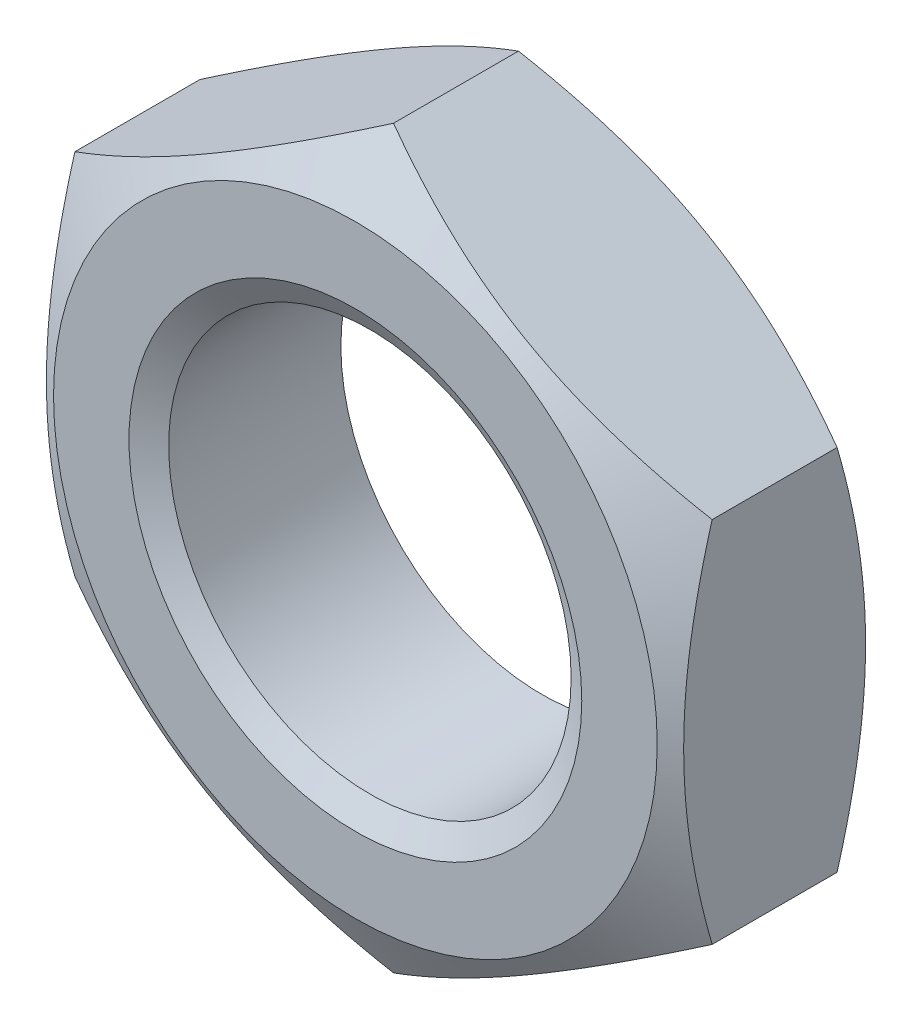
ISO-10303-21;
HEADER;
FILE_DESCRIPTION(('STEP AP214'),'2;1');
FILE_NAME('part.step','',(''),(''),'','','');
FILE_SCHEMA(('AUTOMOTIVE_DESIGN { 1 0 10303 214 1 1 1 1 }'));
ENDSEC;
DATA;
#1=APPLICATION_CONTEXT('core data for automotive mechanical design processes');
#2=APPLICATION_PROTOCOL_DEFINITION('international standard','automotive_design',2000,#1);
#3=PRODUCT_CONTEXT('',#1,'mechanical');
#4=PRODUCT('Part','Part','',(#3));
#5=PRODUCT_RELATED_PRODUCT_CATEGORY('part','',(#4));
#6=PRODUCT_DEFINITION_FORMATION('','',#4);
#7=PRODUCT_DEFINITION_CONTEXT('part definition',#1,'design');
#8=PRODUCT_DEFINITION('design','',#6,#7);
#9=PRODUCT_DEFINITION_SHAPE('','',#8);
#10=(LENGTH_UNIT() NAMED_UNIT(*) SI_UNIT(.MILLI.,.METRE.));
#11=(NAMED_UNIT(*) PLANE_ANGLE_UNIT() SI_UNIT($,.RADIAN.));
#12=(NAMED_UNIT(*) SI_UNIT($,.STERADIAN.) SOLID_ANGLE_UNIT());
#13=UNCERTAINTY_MEASURE_WITH_UNIT(LENGTH_MEASURE(1.E-05),#10,'distance_accuracy_value','');
#14=(GEOMETRIC_REPRESENTATION_CONTEXT(3) GLOBAL_UNCERTAINTY_ASSIGNED_CONTEXT((#13)) GLOBAL_UNIT_ASSIGNED_CONTEXT((#10,
#11,#12)) REPRESENTATION_CONTEXT('',''));
#15=CARTESIAN_POINT('',(0.,0.,0.));
#16=DIRECTION('',(0.,0.,1.));
#17=DIRECTION('',(1.,0.,0.));
#18=AXIS2_PLACEMENT_3D('',#15,#16,#17);
#19=CARTESIAN_POINT('',(0.,0.,0.));
#20=DIRECTION('',(0.,0.,1.));
#21=DIRECTION('',(1.,0.,0.));
#22=AXIS2_PLACEMENT_3D('',#19,#20,#21);
#23=PLANE('',#22);
#24=CARTESIAN_POINT('',(0.,0.,0.));
#25=DIRECTION('',(0.,0.,1.));
#26=DIRECTION('',(1.,0.,0.));
#27=AXIS2_PLACEMENT_3D('',#24,#25,#26);
#28=CIRCLE('',#27,6.75);
#29=CARTESIAN_POINT('',(6.75,0.,0.));
#30=VERTEX_POINT('',#29);
#31=EDGE_CURVE('E23',#30,#30,#28,.T.);
#32=ORIENTED_EDGE('',*,*,#31,.T.);
#33=EDGE_LOOP('',(#32));
#34=FACE_BOUND('',#33,.T.);
#35=CARTESIAN_POINT('',(0.,0.,0.));
#36=DIRECTION('',(0.,0.,-1.));
#37=DIRECTION('',(-1.,0.,0.));
#38=AXIS2_PLACEMENT_3D('',#35,#36,#37);
#39=CIRCLE('',#38,9.);
#40=CARTESIAN_POINT('',(-9.,0.,0.));
#41=VERTEX_POINT('',#40);
#42=EDGE_CURVE('E146',#41,#41,#39,.T.);
#43=ORIENTED_EDGE('',*,*,#42,.T.);
#44=EDGE_LOOP('',(#43));
#45=FACE_BOUND('',#44,.T.);
#46=ADVANCED_FACE('F14',(#34,#45),#23,.F.);
#47=CARTESIAN_POINT('',(0.,0.,6.));
#48=DIRECTION('',(0.,0.,1.));
#49=DIRECTION('',(1.,0.,0.));
#50=AXIS2_PLACEMENT_3D('',#47,#48,#49);
#51=PLANE('',#50);
#52=CARTESIAN_POINT('',(0.,0.,6.));
#53=DIRECTION('',(0.,0.,1.));
#54=DIRECTION('',(1.,0.,0.));
#55=AXIS2_PLACEMENT_3D('',#52,#53,#54);
#56=CIRCLE('',#55,6.75);
#57=CARTESIAN_POINT('',(6.75,0.,6.));
#58=VERTEX_POINT('',#57);
#59=EDGE_CURVE('E9',#58,#58,#56,.F.);
#60=ORIENTED_EDGE('',*,*,#59,.T.);
#61=EDGE_LOOP('',(#60));
#62=FACE_BOUND('',#61,.T.);
#63=CARTESIAN_POINT('',(0.,0.,6.));
#64=DIRECTION('',(0.,0.,-1.));
#65=DIRECTION('',(-1.,0.,0.));
#66=AXIS2_PLACEMENT_3D('',#63,#64,#65);
#67=CIRCLE('',#66,9.);
#68=CARTESIAN_POINT('',(-9.,0.,6.));
#69=VERTEX_POINT('',#68);
#70=EDGE_CURVE('E214',#69,#69,#67,.T.);
#71=ORIENTED_EDGE('',*,*,#70,.F.);
#72=EDGE_LOOP('',(#71));
#73=FACE_BOUND('',#72,.T.);
#74=ADVANCED_FACE('F239',(#62,#73),#51,.T.);
#75=CARTESIAN_POINT('',(9.5,5.48482755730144,6.));
#76=DIRECTION('',(-0.5,-0.866025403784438,0.));
#77=DIRECTION('',(0.866025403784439,-0.5,0.));
#78=AXIS2_PLACEMENT_3D('',#75,#76,#77);
#79=PLANE('',#78);
#80=DIRECTION('',(0.,0.,-1.));
#81=VECTOR('',#80,1.);
#82=CARTESIAN_POINT('',(9.5,5.48482755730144,6.));
#83=LINE('',#82,#81);
#84=CARTESIAN_POINT('',(9.5,5.48482755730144,4.8628190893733));
#85=VERTEX_POINT('',#84);
#86=CARTESIAN_POINT('',(9.5,5.48482755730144,1.1371809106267));
#87=VERTEX_POINT('',#86);
#88=EDGE_CURVE('E203',#85,#87,#83,.T.);
#89=ORIENTED_EDGE('',*,*,#88,.T.);
#90=CARTESIAN_POINT('',(9.5002,5.4847120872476,1.13724757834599));
#91=CARTESIAN_POINT('',(9.2913692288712,5.60528058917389,1.06764857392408));
#92=CARTESIAN_POINT('',(9.08175982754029,5.72629863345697,1.00120844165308));
#93=CARTESIAN_POINT('',(8.66086011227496,5.96930519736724,0.875522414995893));
#94=CARTESIAN_POINT('',(8.44956926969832,6.09129402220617,0.816278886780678));
#95=CARTESIAN_POINT('',(7.81229220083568,6.45922610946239,0.650489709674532));
#96=CARTESIAN_POINT('',(7.38379023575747,6.70662183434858,0.556189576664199));
#97=CARTESIAN_POINT('',(6.74255666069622,7.07683821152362,0.445613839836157));
#98=CARTESIAN_POINT('',(6.53174078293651,7.19855281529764,0.41411496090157));
#99=CARTESIAN_POINT('',(6.10913296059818,7.44254555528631,0.361293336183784));
#100=CARTESIAN_POINT('',(5.89734099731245,7.56482370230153,0.339970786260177));
#101=CARTESIAN_POINT('',(5.4734037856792,7.80958396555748,0.308048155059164));
#102=CARTESIAN_POINT('',(5.26125925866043,7.93206566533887,0.297435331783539));
#103=CARTESIAN_POINT('',(4.83677424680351,8.17714220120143,0.28715766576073));
#104=CARTESIAN_POINT('',(4.62443376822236,8.29973703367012,0.287492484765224));
#105=CARTESIAN_POINT('',(4.22745800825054,8.52893109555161,0.29834850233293));
#106=CARTESIAN_POINT('',(4.04279470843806,8.63554650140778,0.30754540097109));
#107=CARTESIAN_POINT('',(3.67389999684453,8.84852796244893,0.33404053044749));
#108=CARTESIAN_POINT('',(3.48966861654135,8.95489399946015,0.351339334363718));
#109=CARTESIAN_POINT('',(2.93768832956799,9.27357996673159,0.414979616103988));
#110=CARTESIAN_POINT('',(2.57091646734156,9.4853358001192,0.473057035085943));
#111=CARTESIAN_POINT('',(1.83348217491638,9.91109368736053,0.618251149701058));
#112=CARTESIAN_POINT('',(1.46291385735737,10.1250414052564,0.705983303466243));
#113=CARTESIAN_POINT('',(0.727303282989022,10.5497463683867,0.905098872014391));
#114=CARTESIAN_POINT('',(0.362251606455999,10.7605090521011,1.01643552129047));
#115=CARTESIAN_POINT('',(-0.000199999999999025,10.9697705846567,1.13724757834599));
#116=B_SPLINE_CURVE_WITH_KNOTS('',3,(#90,#91,#92,#93,#94,#95,#96,#97,#98,#99,#100,#101,#102,
#103,#104,#105,#106,#107,#108,#109,#110,#111,#112,#113,#114,#115),.UNSPECIFIED.,.F.,.F.,(4,2,2,
2,2,2,2,2,2,2,2,2,4),(0.,0.752880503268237,1.50600787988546,3.01546870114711,3.75167336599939,
4.48789219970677,5.22323407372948,5.95855322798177,6.59868084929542,7.23885375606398,
8.52010929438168,9.82978009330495,11.1368800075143),.UNSPECIFIED.);
#117=CARTESIAN_POINT('',(0.,10.9696551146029,1.1371809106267));
#118=VERTEX_POINT('',#117);
#119=EDGE_CURVE('E30',#87,#118,#116,.T.);
#120=ORIENTED_EDGE('',*,*,#119,.T.);
#121=DIRECTION('',(0.,0.,-1.));
#122=VECTOR('',#121,1.);
#123=CARTESIAN_POINT('',(0.,10.9696551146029,6.));
#124=LINE('',#123,#122);
#125=CARTESIAN_POINT('',(0.,10.9696551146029,4.8628190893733));
#126=VERTEX_POINT('',#125);
#127=EDGE_CURVE('E84',#126,#118,#124,.T.);
#128=ORIENTED_EDGE('',*,*,#127,.F.);
#129=CARTESIAN_POINT('',(-0.000199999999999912,10.9697705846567,4.86275242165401));
#130=CARTESIAN_POINT('',(0.208630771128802,10.8492020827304,4.93235142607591));
#131=CARTESIAN_POINT('',(0.418240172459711,10.7281840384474,4.99879155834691));
#132=CARTESIAN_POINT('',(0.83913988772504,10.4851774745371,5.1244775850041));
#133=CARTESIAN_POINT('',(1.05043073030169,10.3631886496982,5.18372111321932));
#134=CARTESIAN_POINT('',(1.68770779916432,9.99525656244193,5.34951029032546));
#135=CARTESIAN_POINT('',(2.11620976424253,9.74786083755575,5.4438104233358));
#136=CARTESIAN_POINT('',(2.75744333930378,9.37764446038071,5.55438616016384));
#137=CARTESIAN_POINT('',(2.96825921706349,9.25592985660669,5.58588503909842));
#138=CARTESIAN_POINT('',(3.39086703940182,9.01193711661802,5.63870666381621));
#139=CARTESIAN_POINT('',(3.60265900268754,8.8896589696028,5.66002921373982));
#140=CARTESIAN_POINT('',(4.02659621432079,8.64489870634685,5.69195184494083));
#141=CARTESIAN_POINT('',(4.23874074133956,8.52241700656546,5.70256466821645));
#142=CARTESIAN_POINT('',(4.66322575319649,8.2773404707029,5.71284233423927));
#143=CARTESIAN_POINT('',(4.87556623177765,8.15474563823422,5.71250751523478));
#144=CARTESIAN_POINT('',(5.27254199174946,7.92555157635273,5.70165149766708));
#145=CARTESIAN_POINT('',(5.45720529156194,7.81893617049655,5.69245459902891));
#146=CARTESIAN_POINT('',(5.82610000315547,7.6059547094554,5.6659594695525));
#147=CARTESIAN_POINT('',(6.01033138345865,7.49958867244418,5.64866066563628));
#148=CARTESIAN_POINT('',(6.56231167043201,7.18090270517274,5.58502038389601));
#149=CARTESIAN_POINT('',(6.92908353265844,6.96914687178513,5.52694296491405));
#150=CARTESIAN_POINT('',(7.66651782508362,6.5433889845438,5.38174885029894));
#151=CARTESIAN_POINT('',(8.03708614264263,6.32944126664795,5.29401669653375));
#152=CARTESIAN_POINT('',(8.77269671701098,5.90473630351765,5.0949011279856));
#153=CARTESIAN_POINT('',(9.137748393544,5.69397361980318,4.98356447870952));
#154=CARTESIAN_POINT('',(9.5002,5.4847120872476,4.86275242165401));
#155=B_SPLINE_CURVE_WITH_KNOTS('',3,(#129,#130,#131,#132,#133,#134,#135,#136,#137,#138,#139,
#140,#141,#142,#143,#144,#145,#146,#147,#148,#149,#150,#151,#152,#153,#154),.UNSPECIFIED.,.F.,
.F.,(4,2,2,2,2,2,2,2,2,2,2,2,4),(0.,0.752880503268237,1.50600787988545,3.0154687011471,
3.75167336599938,4.48789219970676,5.22323407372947,5.95855322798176,6.59868084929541,
7.23885375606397,8.52010929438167,9.82978009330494,11.1368800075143),.UNSPECIFIED.);
#156=EDGE_CURVE('E192',#126,#85,#155,.T.);
#157=ORIENTED_EDGE('',*,*,#156,.T.);
#158=EDGE_LOOP('',(#89,#120,#128,#157));
#159=FACE_BOUND('',#158,.T.);
#160=ADVANCED_FACE('F180',(#159),#79,.F.);
#161=CARTESIAN_POINT('',(0.,10.9696551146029,6.));
#162=DIRECTION('',(0.5,-0.866025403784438,0.));
#163=DIRECTION('',(0.866025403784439,0.5,0.));
#164=AXIS2_PLACEMENT_3D('',#161,#162,#163);
#165=PLANE('',#164);
#166=ORIENTED_EDGE('',*,*,#127,.T.);
#167=CARTESIAN_POINT('',(0.000200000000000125,10.9697705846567,1.13724757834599));
#168=CARTESIAN_POINT('',(-0.208630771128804,10.8492020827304,1.06764857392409));
#169=CARTESIAN_POINT('',(-0.418240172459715,10.7281840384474,1.00120844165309));
#170=CARTESIAN_POINT('',(-0.839139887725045,10.4851774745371,0.875522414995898));
#171=CARTESIAN_POINT('',(-1.05043073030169,10.3631886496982,0.816278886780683));
#172=CARTESIAN_POINT('',(-1.68770779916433,9.99525656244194,0.650489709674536));
#173=CARTESIAN_POINT('',(-2.11620976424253,9.74786083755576,0.556189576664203));
#174=CARTESIAN_POINT('',(-2.75744333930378,9.37764446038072,0.445613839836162));
#175=CARTESIAN_POINT('',(-2.9682592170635,9.2559298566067,0.414114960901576));
#176=CARTESIAN_POINT('',(-3.39086703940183,9.01193711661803,0.361293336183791));
#177=CARTESIAN_POINT('',(-3.60265900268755,8.88965896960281,0.339970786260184));
#178=CARTESIAN_POINT('',(-4.0265962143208,8.64489870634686,0.308048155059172));
#179=CARTESIAN_POINT('',(-4.23874074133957,8.52241700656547,0.297435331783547));
#180=CARTESIAN_POINT('',(-4.66322575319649,8.27734047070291,0.287157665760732));
#181=CARTESIAN_POINT('',(-4.87556623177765,8.15474563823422,0.287492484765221));
#182=CARTESIAN_POINT('',(-5.27254199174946,7.92555157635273,0.298348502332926));
#183=CARTESIAN_POINT('',(-5.45720529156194,7.81893617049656,0.307545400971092));
#184=CARTESIAN_POINT('',(-5.82610000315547,7.60595470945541,0.334040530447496));
#185=CARTESIAN_POINT('',(-6.01033138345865,7.49958867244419,0.351339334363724));
#186=CARTESIAN_POINT('',(-6.56231167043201,7.18090270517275,0.414979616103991));
#187=CARTESIAN_POINT('',(-6.92908353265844,6.96914687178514,0.473057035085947));
#188=CARTESIAN_POINT('',(-7.66651782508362,6.5433889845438,0.618251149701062));
#189=CARTESIAN_POINT('',(-8.03708614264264,6.32944126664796,0.705983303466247));
#190=CARTESIAN_POINT('',(-8.77269671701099,5.90473630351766,0.905098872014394));
#191=CARTESIAN_POINT('',(-9.13774839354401,5.69397361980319,1.01643552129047));
#192=CARTESIAN_POINT('',(-9.5002,5.4847120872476,1.13724757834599));
#193=B_SPLINE_CURVE_WITH_KNOTS('',3,(#167,#168,#169,#170,#171,#172,#173,#174,#175,#176,#177,
#178,#179,#180,#181,#182,#183,#184,#185,#186,#187,#188,#189,#190,#191,#192),.UNSPECIFIED.,.F.,
.F.,(4,2,2,2,2,2,2,2,2,2,2,2,4),(0.,0.752880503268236,1.50600787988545,3.0154687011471,
3.75167336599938,4.48789219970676,5.22323407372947,5.95855322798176,6.59868084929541,
7.23885375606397,8.52010929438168,9.82978009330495,11.1368800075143),.UNSPECIFIED.);
#194=CARTESIAN_POINT('',(-9.5,5.48482755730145,1.1371809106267));
#195=VERTEX_POINT('',#194);
#196=EDGE_CURVE('E69',#118,#195,#193,.T.);
#197=ORIENTED_EDGE('',*,*,#196,.T.);
#198=DIRECTION('',(0.,0.,-1.));
#199=VECTOR('',#198,1.);
#200=CARTESIAN_POINT('',(-9.5,5.48482755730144,6.));
#201=LINE('',#200,#199);
#202=CARTESIAN_POINT('',(-9.5,5.48482755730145,4.8628190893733));
#203=VERTEX_POINT('',#202);
#204=EDGE_CURVE('E82',#203,#195,#201,.T.);
#205=ORIENTED_EDGE('',*,*,#204,.F.);
#206=CARTESIAN_POINT('',(-9.5002,5.4847120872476,4.86275242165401));
#207=CARTESIAN_POINT('',(-9.2913692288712,5.6052805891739,4.93235142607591));
#208=CARTESIAN_POINT('',(-9.0817598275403,5.72629863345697,4.99879155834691));
#209=CARTESIAN_POINT('',(-8.66086011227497,5.96930519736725,5.1244775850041));
#210=CARTESIAN_POINT('',(-8.44956926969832,6.09129402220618,5.18372111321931));
#211=CARTESIAN_POINT('',(-7.81229220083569,6.4592261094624,5.34951029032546));
#212=CARTESIAN_POINT('',(-7.38379023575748,6.70662183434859,5.44381042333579));
#213=CARTESIAN_POINT('',(-6.74255666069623,7.07683821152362,5.55438616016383));
#214=CARTESIAN_POINT('',(-6.53174078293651,7.19855281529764,5.58588503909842));
#215=CARTESIAN_POINT('',(-6.10913296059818,7.44254555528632,5.63870666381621));
#216=CARTESIAN_POINT('',(-5.89734099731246,7.56482370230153,5.66002921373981));
#217=CARTESIAN_POINT('',(-5.47340378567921,7.80958396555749,5.69195184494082));
#218=CARTESIAN_POINT('',(-5.26125925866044,7.93206566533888,5.70256466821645));
#219=CARTESIAN_POINT('',(-4.83677424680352,8.17714220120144,5.71284233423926));
#220=CARTESIAN_POINT('',(-4.62443376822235,8.29973703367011,5.71250751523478));
#221=CARTESIAN_POINT('',(-4.22745800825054,8.5289310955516,5.70165149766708));
#222=CARTESIAN_POINT('',(-4.04279470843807,8.63554650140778,5.6924545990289));
#223=CARTESIAN_POINT('',(-3.67389999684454,8.84852796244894,5.6659594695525));
#224=CARTESIAN_POINT('',(-3.48966861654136,8.95489399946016,5.64866066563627));
#225=CARTESIAN_POINT('',(-2.937688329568,9.27357996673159,5.58502038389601));
#226=CARTESIAN_POINT('',(-2.57091646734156,9.4853358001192,5.52694296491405));
#227=CARTESIAN_POINT('',(-1.83348217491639,9.91109368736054,5.38174885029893));
#228=CARTESIAN_POINT('',(-1.46291385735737,10.1250414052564,5.29401669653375));
#229=CARTESIAN_POINT('',(-0.727303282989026,10.5497463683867,5.0949011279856));
#230=CARTESIAN_POINT('',(-0.362251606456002,10.7605090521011,4.98356447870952));
#231=CARTESIAN_POINT('',(0.000199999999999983,10.9697705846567,4.86275242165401));
#232=B_SPLINE_CURVE_WITH_KNOTS('',3,(#206,#207,#208,#209,#210,#211,#212,#213,#214,#215,#216,
#217,#218,#219,#220,#221,#222,#223,#224,#225,#226,#227,#228,#229,#230,#231),.UNSPECIFIED.,.F.,
.F.,(4,2,2,2,2,2,2,2,2,2,2,2,4),(0.,0.752880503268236,1.50600787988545,3.01546870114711,
3.75167336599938,4.48789219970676,5.22323407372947,5.95855322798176,6.59868084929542,
7.23885375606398,8.52010929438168,9.82978009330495,11.1368800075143),.UNSPECIFIED.);
#233=EDGE_CURVE('E185',#203,#126,#232,.T.);
#234=ORIENTED_EDGE('',*,*,#233,.T.);
#235=EDGE_LOOP('',(#166,#197,#205,#234));
#236=FACE_BOUND('',#235,.T.);
#237=ADVANCED_FACE('F80',(#236),#165,.F.);
#238=CARTESIAN_POINT('',(-9.5,5.48482755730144,6.));
#239=DIRECTION('',(1.,0.,0.));
#240=DIRECTION('',(0.,1.,0.));
#241=AXIS2_PLACEMENT_3D('',#238,#239,#240);
#242=PLANE('',#241);
#243=ORIENTED_EDGE('',*,*,#204,.T.);
#244=CARTESIAN_POINT('',(-9.5,-14.5065695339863,4.81535028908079));
#245=CARTESIAN_POINT('',(-9.5,-14.2981803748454,4.71470113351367));
#246=CARTESIAN_POINT('',(-9.5,-14.0895381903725,4.61457610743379));
#247=CARTESIAN_POINT('',(-9.5,-13.6716943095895,4.41549471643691));
#248=CARTESIAN_POINT('',(-9.5,-13.4624926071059,4.31653836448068));
#249=CARTESIAN_POINT('',(-9.5,-12.8339061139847,4.02157394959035));
#250=CARTESIAN_POINT('',(-9.5,-12.4136083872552,3.82750368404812));
#251=CARTESIAN_POINT('',(-9.5,-11.5676692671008,3.44467254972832));
#252=CARTESIAN_POINT('',(-9.5,-11.1420110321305,3.25594880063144));
#253=CARTESIAN_POINT('',(-9.5,-10.2871819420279,2.8866620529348));
#254=CARTESIAN_POINT('',(-9.5,-9.85801127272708,2.70609862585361));
#255=CARTESIAN_POINT('',(-9.5,-8.99033241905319,2.35324202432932));
#256=CARTESIAN_POINT('',(-9.5,-8.55177384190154,2.18107207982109));
#257=CARTESIAN_POINT('',(-9.5,-7.66947089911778,1.85031632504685));
#258=CARTESIAN_POINT('',(-9.5,-7.22572596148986,1.69173202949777));
#259=CARTESIAN_POINT('',(-9.5,-6.33326362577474,1.39243889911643));
#260=CARTESIAN_POINT('',(-9.5,-5.88455923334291,1.25169170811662));
#261=CARTESIAN_POINT('',(-9.5,-4.98078962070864,0.992667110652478));
#262=CARTESIAN_POINT('',(-9.5,-4.52572647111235,0.874382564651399));
#263=CARTESIAN_POINT('',(-9.5,-3.60883640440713,0.66605624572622));
#264=CARTESIAN_POINT('',(-9.5,-3.1470072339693,0.576024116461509));
#265=CARTESIAN_POINT('',(-9.5,-2.45023418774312,0.466696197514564));
#266=CARTESIAN_POINT('',(-9.5,-2.21727642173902,0.434537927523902));
#267=CARTESIAN_POINT('',(-9.5,-1.75028178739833,0.37942806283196));
#268=CARTESIAN_POINT('',(-9.5,-1.51624502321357,0.356475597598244));
#269=CARTESIAN_POINT('',(-9.5,-1.04887134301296,0.320393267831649));
#270=CARTESIAN_POINT('',(-9.5,-0.815539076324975,0.30720342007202));
#271=CARTESIAN_POINT('',(-9.5,-0.348526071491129,0.290715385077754));
#272=CARTESIAN_POINT('',(-9.5,-0.114845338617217,0.2874170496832));
#273=CARTESIAN_POINT('',(-9.5,0.352380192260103,0.290790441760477));
#274=CARTESIAN_POINT('',(-9.5,0.585925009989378,0.297459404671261));
#275=CARTESIAN_POINT('',(-9.5,1.0525315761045,0.320602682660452));
#276=CARTESIAN_POINT('',(-9.5,1.28559329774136,0.33707752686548));
#277=CARTESIAN_POINT('',(-9.5,1.85158126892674,0.388651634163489));
#278=CARTESIAN_POINT('',(-9.5,2.1840628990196,0.428725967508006));
#279=CARTESIAN_POINT('',(-9.5,2.84639454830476,0.526590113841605));
#280=CARTESIAN_POINT('',(-9.5,3.17624416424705,0.584382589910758));
#281=CARTESIAN_POINT('',(-9.5,4.16243374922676,0.78143565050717));
#282=CARTESIAN_POINT('',(-9.5,4.8141225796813,0.94423923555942));
#283=CARTESIAN_POINT('',(-9.5,5.78886162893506,1.22462306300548));
#284=CARTESIAN_POINT('',(-9.5,6.11701310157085,1.32547253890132));
#285=CARTESIAN_POINT('',(-9.5,6.77014596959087,1.53714458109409));
#286=CARTESIAN_POINT('',(-9.5,7.09512707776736,1.64796804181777));
#287=CARTESIAN_POINT('',(-9.5,7.7402963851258,1.87721956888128));
#288=CARTESIAN_POINT('',(-9.5,8.06050129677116,1.99560107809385));
#289=CARTESIAN_POINT('',(-9.5,8.69819174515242,2.23916705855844));
#290=CARTESIAN_POINT('',(-9.5,9.01567818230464,2.36434916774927));
#291=CARTESIAN_POINT('',(-9.5,9.33202092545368,2.49229376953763));
#292=B_SPLINE_CURVE_WITH_KNOTS('',3,(#244,#245,#246,#247,#248,#249,#250,#251,#252,#253,#254,
#255,#256,#257,#258,#259,#260,#261,#262,#263,#264,#265,#266,#267,#268,#269,#270,#271,#272,#273,
#274,#275,#276,#277,#278,#279,#280,#281,#282,#283,#284,#285,#286,#287,#288,#289,#290,#291),
.UNSPECIFIED.,.F.,.F.,(4,2,2,2,2,2,2,2,2,2,2,2,2,2,2,2,2,2,2,2,2,2,2,4),(0.,0.694265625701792,
1.38853894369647,2.77731373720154,4.1741060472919,5.57082492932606,6.98408071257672,
8.39749386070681,9.80781414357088,11.217685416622,12.6280374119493,13.333384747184,
14.0386653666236,14.7395758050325,15.4404757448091,16.1411813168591,16.8419247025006,
17.8460174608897,18.8502612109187,20.8626274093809,21.8924446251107,22.9223542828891,
23.9464387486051,24.9701697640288),.UNSPECIFIED.);
#293=CARTESIAN_POINT('',(-9.5,-5.48482755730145,1.1371809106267));
#294=VERTEX_POINT('',#293);
#295=EDGE_CURVE('E66',#195,#294,#292,.F.);
#296=ORIENTED_EDGE('',*,*,#295,.T.);
#297=DIRECTION('',(0.,0.,-1.));
#298=VECTOR('',#297,1.);
#299=CARTESIAN_POINT('',(-9.5,-5.48482755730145,6.));
#300=LINE('',#299,#298);
#301=CARTESIAN_POINT('',(-9.5,-5.48482755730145,4.8628190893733));
#302=VERTEX_POINT('',#301);
#303=EDGE_CURVE('E89',#302,#294,#300,.T.);
#304=ORIENTED_EDGE('',*,*,#303,.F.);
#305=CARTESIAN_POINT('',(-9.5,-14.5065695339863,1.18464971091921));
#306=CARTESIAN_POINT('',(-9.5,-14.2981803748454,1.28529886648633));
#307=CARTESIAN_POINT('',(-9.5,-14.0895381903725,1.38542389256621));
#308=CARTESIAN_POINT('',(-9.5,-13.6716943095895,1.58450528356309));
#309=CARTESIAN_POINT('',(-9.5,-13.4624926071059,1.68346163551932));
#310=CARTESIAN_POINT('',(-9.5,-12.8339061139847,1.97842605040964));
#311=CARTESIAN_POINT('',(-9.5,-12.4136083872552,2.17249631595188));
#312=CARTESIAN_POINT('',(-9.5,-11.5676692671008,2.55532745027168));
#313=CARTESIAN_POINT('',(-9.5,-11.1420110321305,2.74405119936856));
#314=CARTESIAN_POINT('',(-9.5,-10.2871819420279,3.1133379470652));
#315=CARTESIAN_POINT('',(-9.5,-9.85801127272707,3.29390137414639));
#316=CARTESIAN_POINT('',(-9.5,-8.99033241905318,3.64675797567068));
#317=CARTESIAN_POINT('',(-9.5,-8.55177384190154,3.8189279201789));
#318=CARTESIAN_POINT('',(-9.5,-7.66947089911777,4.14968367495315));
#319=CARTESIAN_POINT('',(-9.5,-7.22572596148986,4.30826797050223));
#320=CARTESIAN_POINT('',(-9.5,-6.33326362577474,4.60756110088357));
#321=CARTESIAN_POINT('',(-9.5,-5.8845592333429,4.74830829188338));
#322=CARTESIAN_POINT('',(-9.5,-4.98078962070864,5.00733288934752));
#323=CARTESIAN_POINT('',(-9.5,-4.52572647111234,5.12561743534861));
#324=CARTESIAN_POINT('',(-9.5,-3.60883640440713,5.33394375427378));
#325=CARTESIAN_POINT('',(-9.5,-3.1470072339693,5.42397588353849));
#326=CARTESIAN_POINT('',(-9.5,-2.45023418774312,5.53330380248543));
#327=CARTESIAN_POINT('',(-9.5,-2.21727642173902,5.56546207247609));
#328=CARTESIAN_POINT('',(-9.5,-1.75028178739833,5.62057193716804));
#329=CARTESIAN_POINT('',(-9.5,-1.51624502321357,5.64352440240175));
#330=CARTESIAN_POINT('',(-9.5,-1.04887134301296,5.67960673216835));
#331=CARTESIAN_POINT('',(-9.5,-0.815539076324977,5.69279657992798));
#332=CARTESIAN_POINT('',(-9.5,-0.348526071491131,5.70928461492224));
#333=CARTESIAN_POINT('',(-9.5,-0.114845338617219,5.7125829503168));
#334=CARTESIAN_POINT('',(-9.5,0.352380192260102,5.70920955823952));
#335=CARTESIAN_POINT('',(-9.5,0.585925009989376,5.70254059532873));
#336=CARTESIAN_POINT('',(-9.5,1.0525315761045,5.67939731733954));
#337=CARTESIAN_POINT('',(-9.5,1.28559329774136,5.66292247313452));
#338=CARTESIAN_POINT('',(-9.5,1.85158126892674,5.61134836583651));
#339=CARTESIAN_POINT('',(-9.5,2.1840628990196,5.57127403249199));
#340=CARTESIAN_POINT('',(-9.5,2.84639454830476,5.47340988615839));
#341=CARTESIAN_POINT('',(-9.5,3.17624416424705,5.41561741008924));
#342=CARTESIAN_POINT('',(-9.5,4.16243374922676,5.21856434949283));
#343=CARTESIAN_POINT('',(-9.5,4.8141225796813,5.05576076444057));
#344=CARTESIAN_POINT('',(-9.5,5.78886162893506,4.77537693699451));
#345=CARTESIAN_POINT('',(-9.5,6.11701310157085,4.67452746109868));
#346=CARTESIAN_POINT('',(-9.5,6.77014596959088,4.4628554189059));
#347=CARTESIAN_POINT('',(-9.5,7.09512707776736,4.35203195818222));
#348=CARTESIAN_POINT('',(-9.5,7.7402963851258,4.12278043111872));
#349=CARTESIAN_POINT('',(-9.5,8.06050129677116,4.00439892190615));
#350=CARTESIAN_POINT('',(-9.5,8.69819174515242,3.76083294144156));
#351=CARTESIAN_POINT('',(-9.5,9.01567818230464,3.63565083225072));
#352=CARTESIAN_POINT('',(-9.5,9.33202092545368,3.50770623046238));
#353=B_SPLINE_CURVE_WITH_KNOTS('',3,(#305,#306,#307,#308,#309,#310,#311,#312,#313,#314,#315,
#316,#317,#318,#319,#320,#321,#322,#323,#324,#325,#326,#327,#328,#329,#330,#331,#332,#333,#334,
#335,#336,#337,#338,#339,#340,#341,#342,#343,#344,#345,#346,#347,#348,#349,#350,#351,#352),
.UNSPECIFIED.,.F.,.F.,(4,2,2,2,2,2,2,2,2,2,2,2,2,2,2,2,2,2,2,2,2,2,2,4),(0.,0.694265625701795,
1.38853894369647,2.77731373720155,4.1741060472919,5.57082492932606,6.98408071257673,
8.39749386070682,9.80781414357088,11.217685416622,12.6280374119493,13.333384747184,
14.0386653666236,14.7395758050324,15.4404757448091,16.1411813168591,16.8419247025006,
17.8460174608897,18.8502612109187,20.8626274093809,21.8924446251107,22.9223542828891,
23.9464387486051,24.9701697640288),.UNSPECIFIED.);
#354=EDGE_CURVE('E88',#302,#203,#353,.T.);
#355=ORIENTED_EDGE('',*,*,#354,.T.);
#356=EDGE_LOOP('',(#243,#296,#304,#355));
#357=FACE_BOUND('',#356,.T.);
#358=ADVANCED_FACE('F87',(#357),#242,.F.);
#359=CARTESIAN_POINT('',(-9.5,-5.48482755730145,6.));
#360=DIRECTION('',(0.5,0.866025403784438,0.));
#361=DIRECTION('',(-0.866025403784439,0.5,0.));
#362=AXIS2_PLACEMENT_3D('',#359,#360,#361);
#363=PLANE('',#362);
#364=ORIENTED_EDGE('',*,*,#303,.T.);
#365=CARTESIAN_POINT('',(-9.5002,-5.48471208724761,1.13724757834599));
#366=CARTESIAN_POINT('',(-9.2913692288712,-5.6052805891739,1.06764857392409));
#367=CARTESIAN_POINT('',(-9.08175982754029,-5.72629863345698,1.00120844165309));
#368=CARTESIAN_POINT('',(-8.66086011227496,-5.96930519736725,0.875522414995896));
#369=CARTESIAN_POINT('',(-8.44956926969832,-6.09129402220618,0.816278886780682));
#370=CARTESIAN_POINT('',(-7.81229220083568,-6.4592261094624,0.650489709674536));
#371=CARTESIAN_POINT('',(-7.38379023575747,-6.70662183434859,0.556189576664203));
#372=CARTESIAN_POINT('',(-6.74255666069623,-7.07683821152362,0.445613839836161));
#373=CARTESIAN_POINT('',(-6.53174078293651,-7.19855281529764,0.414114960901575));
#374=CARTESIAN_POINT('',(-6.10913296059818,-7.44254555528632,0.361293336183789));
#375=CARTESIAN_POINT('',(-5.89734099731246,-7.56482370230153,0.339970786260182));
#376=CARTESIAN_POINT('',(-5.47340378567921,-7.80958396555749,0.30804815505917));
#377=CARTESIAN_POINT('',(-5.26125925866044,-7.93206566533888,0.297435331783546));
#378=CARTESIAN_POINT('',(-4.83677424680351,-8.17714220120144,0.287157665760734));
#379=CARTESIAN_POINT('',(-4.62443376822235,-8.29973703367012,0.287492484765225));
#380=CARTESIAN_POINT('',(-4.22745800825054,-8.52893109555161,0.298348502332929));
#381=CARTESIAN_POINT('',(-4.04279470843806,-8.63554650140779,0.307545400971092));
#382=CARTESIAN_POINT('',(-3.67389999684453,-8.84852796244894,0.334040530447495));
#383=CARTESIAN_POINT('',(-3.48966861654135,-8.95489399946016,0.351339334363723));
#384=CARTESIAN_POINT('',(-2.93768832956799,-9.27357996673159,0.414979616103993));
#385=CARTESIAN_POINT('',(-2.57091646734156,-9.48533580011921,0.473057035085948));
#386=CARTESIAN_POINT('',(-1.83348217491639,-9.91109368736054,0.618251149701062));
#387=CARTESIAN_POINT('',(-1.46291385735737,-10.1250414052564,0.705983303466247));
#388=CARTESIAN_POINT('',(-0.727303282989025,-10.5497463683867,0.905098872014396));
#389=CARTESIAN_POINT('',(-0.362251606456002,-10.7605090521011,1.01643552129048));
#390=CARTESIAN_POINT('',(0.000199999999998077,-10.9697705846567,1.13724757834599));
#391=B_SPLINE_CURVE_WITH_KNOTS('',3,(#365,#366,#367,#368,#369,#370,#371,#372,#373,#374,#375,
#376,#377,#378,#379,#380,#381,#382,#383,#384,#385,#386,#387,#388,#389,#390),.UNSPECIFIED.,.F.,
.F.,(4,2,2,2,2,2,2,2,2,2,2,2,4),(0.,0.752880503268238,1.50600787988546,3.01546870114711,
3.75167336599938,4.48789219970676,5.22323407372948,5.95855322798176,6.59868084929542,
7.23885375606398,8.52010929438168,9.82978009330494,11.1368800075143),.UNSPECIFIED.);
#392=CARTESIAN_POINT('',(0.,-10.9696551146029,1.1371809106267));
#393=VERTEX_POINT('',#392);
#394=EDGE_CURVE('E71',#294,#393,#391,.T.);
#395=ORIENTED_EDGE('',*,*,#394,.T.);
#396=DIRECTION('',(0.,0.,-1.));
#397=VECTOR('',#396,1.);
#398=CARTESIAN_POINT('',(0.,-10.9696551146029,6.));
#399=LINE('',#398,#397);
#400=CARTESIAN_POINT('',(0.,-10.9696551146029,4.8628190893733));
#401=VERTEX_POINT('',#400);
#402=EDGE_CURVE('E93',#401,#393,#399,.T.);
#403=ORIENTED_EDGE('',*,*,#402,.F.);
#404=CARTESIAN_POINT('',(0.000199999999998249,-10.9697705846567,4.86275242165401));
#405=CARTESIAN_POINT('',(-0.208630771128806,-10.8492020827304,4.93235142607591));
#406=CARTESIAN_POINT('',(-0.418240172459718,-10.7281840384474,4.99879155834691));
#407=CARTESIAN_POINT('',(-0.839139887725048,-10.4851774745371,5.1244775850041));
#408=CARTESIAN_POINT('',(-1.0504307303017,-10.3631886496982,5.18372111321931));
#409=CARTESIAN_POINT('',(-1.68770779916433,-9.99525656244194,5.34951029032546));
#410=CARTESIAN_POINT('',(-2.11620976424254,-9.74786083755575,5.44381042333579));
#411=CARTESIAN_POINT('',(-2.75744333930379,-9.37764446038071,5.55438616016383));
#412=CARTESIAN_POINT('',(-2.9682592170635,-9.2559298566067,5.58588503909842));
#413=CARTESIAN_POINT('',(-3.39086703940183,-9.01193711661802,5.63870666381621));
#414=CARTESIAN_POINT('',(-3.60265900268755,-8.88965896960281,5.66002921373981));
#415=CARTESIAN_POINT('',(-4.02659621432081,-8.64489870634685,5.69195184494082));
#416=CARTESIAN_POINT('',(-4.23874074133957,-8.52241700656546,5.70256466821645));
#417=CARTESIAN_POINT('',(-4.6632257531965,-8.2773404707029,5.71284233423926));
#418=CARTESIAN_POINT('',(-4.87556623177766,-8.15474563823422,5.71250751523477));
#419=CARTESIAN_POINT('',(-5.27254199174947,-7.92555157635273,5.70165149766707));
#420=CARTESIAN_POINT('',(-5.45720529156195,-7.81893617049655,5.6924545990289));
#421=CARTESIAN_POINT('',(-5.82610000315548,-7.6059547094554,5.6659594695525));
#422=CARTESIAN_POINT('',(-6.01033138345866,-7.49958867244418,5.64866066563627));
#423=CARTESIAN_POINT('',(-6.56231167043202,-7.18090270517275,5.585020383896));
#424=CARTESIAN_POINT('',(-6.92908353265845,-6.96914687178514,5.52694296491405));
#425=CARTESIAN_POINT('',(-7.66651782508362,-6.5433889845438,5.38174885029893));
#426=CARTESIAN_POINT('',(-8.03708614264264,-6.32944126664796,5.29401669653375));
#427=CARTESIAN_POINT('',(-8.77269671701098,-5.90473630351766,5.0949011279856));
#428=CARTESIAN_POINT('',(-9.137748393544,-5.69397361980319,4.98356447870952));
#429=CARTESIAN_POINT('',(-9.5002,-5.48471208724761,4.86275242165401));
#430=B_SPLINE_CURVE_WITH_KNOTS('',3,(#404,#405,#406,#407,#408,#409,#410,#411,#412,#413,#414,
#415,#416,#417,#418,#419,#420,#421,#422,#423,#424,#425,#426,#427,#428,#429),.UNSPECIFIED.,.F.,
.F.,(4,2,2,2,2,2,2,2,2,2,2,2,4),(0.,0.752880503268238,1.50600787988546,3.01546870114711,
3.75167336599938,4.48789219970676,5.22323407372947,5.95855322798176,6.59868084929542,
7.23885375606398,8.52010929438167,9.82978009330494,11.1368800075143),.UNSPECIFIED.);
#431=EDGE_CURVE('E213',#401,#302,#430,.T.);
#432=ORIENTED_EDGE('',*,*,#431,.T.);
#433=EDGE_LOOP('',(#364,#395,#403,#432));
#434=FACE_BOUND('',#433,.T.);
#435=ADVANCED_FACE('F125',(#434),#363,.F.);
#436=CARTESIAN_POINT('',(0.,-10.9696551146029,6.));
#437=DIRECTION('',(-0.5,0.866025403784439,0.));
#438=DIRECTION('',(-0.866025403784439,-0.5,0.));
#439=AXIS2_PLACEMENT_3D('',#436,#437,#438);
#440=PLANE('',#439);
#441=ORIENTED_EDGE('',*,*,#402,.T.);
#442=CARTESIAN_POINT('',(-0.000200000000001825,-10.9697705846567,1.13724757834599));
#443=CARTESIAN_POINT('',(0.208630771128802,-10.8492020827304,1.06764857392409));
#444=CARTESIAN_POINT('',(0.418240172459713,-10.7281840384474,1.00120844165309));
#445=CARTESIAN_POINT('',(0.839139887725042,-10.4851774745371,0.875522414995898));
#446=CARTESIAN_POINT('',(1.05043073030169,-10.3631886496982,0.816278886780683));
#447=CARTESIAN_POINT('',(1.68770779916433,-9.99525656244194,0.650489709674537));
#448=CARTESIAN_POINT('',(2.11620976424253,-9.74786083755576,0.556189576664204));
#449=CARTESIAN_POINT('',(2.75744333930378,-9.37764446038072,0.445613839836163));
#450=CARTESIAN_POINT('',(2.9682592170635,-9.2559298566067,0.414114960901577));
#451=CARTESIAN_POINT('',(3.39086703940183,-9.01193711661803,0.361293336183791));
#452=CARTESIAN_POINT('',(3.60265900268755,-8.88965896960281,0.339970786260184));
#453=CARTESIAN_POINT('',(4.0265962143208,-8.64489870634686,0.308048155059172));
#454=CARTESIAN_POINT('',(4.23874074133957,-8.52241700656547,0.297435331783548));
#455=CARTESIAN_POINT('',(4.66322575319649,-8.27734047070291,0.287157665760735));
#456=CARTESIAN_POINT('',(4.87556623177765,-8.15474563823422,0.287492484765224));
#457=CARTESIAN_POINT('',(5.27254199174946,-7.92555157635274,0.29834850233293));
#458=CARTESIAN_POINT('',(5.45720529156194,-7.81893617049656,0.307545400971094));
#459=CARTESIAN_POINT('',(5.82610000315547,-7.60595470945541,0.334040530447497));
#460=CARTESIAN_POINT('',(6.01033138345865,-7.49958867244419,0.351339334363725));
#461=CARTESIAN_POINT('',(6.56231167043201,-7.18090270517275,0.414979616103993));
#462=CARTESIAN_POINT('',(6.92908353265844,-6.96914687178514,0.473057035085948));
#463=CARTESIAN_POINT('',(7.66651782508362,-6.54338898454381,0.618251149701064));
#464=CARTESIAN_POINT('',(8.03708614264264,-6.32944126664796,0.705983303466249));
#465=CARTESIAN_POINT('',(8.77269671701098,-5.90473630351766,0.905098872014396));
#466=CARTESIAN_POINT('',(9.13774839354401,-5.6939736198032,1.01643552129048));
#467=CARTESIAN_POINT('',(9.5002,-5.48471208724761,1.13724757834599));
#468=B_SPLINE_CURVE_WITH_KNOTS('',3,(#442,#443,#444,#445,#446,#447,#448,#449,#450,#451,#452,
#453,#454,#455,#456,#457,#458,#459,#460,#461,#462,#463,#464,#465,#466,#467),.UNSPECIFIED.,.F.,
.F.,(4,2,2,2,2,2,2,2,2,2,2,2,4),(0.,0.752880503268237,1.50600787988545,3.0154687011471,
3.75167336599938,4.48789219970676,5.22323407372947,5.95855322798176,6.59868084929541,
7.23885375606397,8.52010929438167,9.82978009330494,11.1368800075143),.UNSPECIFIED.);
#469=CARTESIAN_POINT('',(9.5,-5.48482755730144,1.1371809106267));
#470=VERTEX_POINT('',#469);
#471=EDGE_CURVE('E138',#393,#470,#468,.T.);
#472=ORIENTED_EDGE('',*,*,#471,.T.);
#473=DIRECTION('',(0.,0.,-1.));
#474=VECTOR('',#473,1.);
#475=CARTESIAN_POINT('',(9.5,-5.48482755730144,6.));
#476=LINE('',#475,#474);
#477=CARTESIAN_POINT('',(9.5,-5.48482755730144,4.86281908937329));
#478=VERTEX_POINT('',#477);
#479=EDGE_CURVE('E206',#478,#470,#476,.T.);
#480=ORIENTED_EDGE('',*,*,#479,.F.);
#481=CARTESIAN_POINT('',(9.5002,-5.48471208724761,4.86275242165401));
#482=CARTESIAN_POINT('',(9.2913692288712,-5.6052805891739,4.93235142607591));
#483=CARTESIAN_POINT('',(9.0817598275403,-5.72629863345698,4.99879155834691));
#484=CARTESIAN_POINT('',(8.66086011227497,-5.96930519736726,5.1244775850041));
#485=CARTESIAN_POINT('',(8.44956926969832,-6.09129402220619,5.18372111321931));
#486=CARTESIAN_POINT('',(7.81229220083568,-6.4592261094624,5.34951029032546));
#487=CARTESIAN_POINT('',(7.38379023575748,-6.70662183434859,5.44381042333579));
#488=CARTESIAN_POINT('',(6.74255666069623,-7.07683821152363,5.55438616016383));
#489=CARTESIAN_POINT('',(6.53174078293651,-7.19855281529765,5.58588503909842));
#490=CARTESIAN_POINT('',(6.10913296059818,-7.44254555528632,5.6387066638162));
#491=CARTESIAN_POINT('',(5.89734099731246,-7.56482370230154,5.66002921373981));
#492=CARTESIAN_POINT('',(5.47340378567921,-7.80958396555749,5.69195184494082));
#493=CARTESIAN_POINT('',(5.26125925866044,-7.93206566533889,5.70256466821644));
#494=CARTESIAN_POINT('',(4.83677424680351,-8.17714220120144,5.71284233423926));
#495=CARTESIAN_POINT('',(4.62443376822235,-8.29973703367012,5.71250751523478));
#496=CARTESIAN_POINT('',(4.22745800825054,-8.52893109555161,5.70165149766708));
#497=CARTESIAN_POINT('',(4.04279470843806,-8.63554650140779,5.6924545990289));
#498=CARTESIAN_POINT('',(3.67389999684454,-8.84852796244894,5.66595946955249));
#499=CARTESIAN_POINT('',(3.48966861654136,-8.95489399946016,5.64866066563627));
#500=CARTESIAN_POINT('',(2.937688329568,-9.27357996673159,5.58502038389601));
#501=CARTESIAN_POINT('',(2.57091646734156,-9.48533580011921,5.52694296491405));
#502=CARTESIAN_POINT('',(1.83348217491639,-9.91109368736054,5.38174885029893));
#503=CARTESIAN_POINT('',(1.46291385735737,-10.1250414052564,5.29401669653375));
#504=CARTESIAN_POINT('',(0.727303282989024,-10.5497463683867,5.0949011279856));
#505=CARTESIAN_POINT('',(0.362251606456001,-10.7605090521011,4.98356447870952));
#506=CARTESIAN_POINT('',(-0.000200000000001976,-10.9697705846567,4.86275242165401));
#507=B_SPLINE_CURVE_WITH_KNOTS('',3,(#481,#482,#483,#484,#485,#486,#487,#488,#489,#490,#491,
#492,#493,#494,#495,#496,#497,#498,#499,#500,#501,#502,#503,#504,#505,#506),.UNSPECIFIED.,.F.,
.F.,(4,2,2,2,2,2,2,2,2,2,2,2,4),(0.,0.752880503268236,1.50600787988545,3.0154687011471,
3.75167336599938,4.48789219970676,5.22323407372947,5.95855322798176,6.59868084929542,
7.23885375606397,8.52010929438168,9.82978009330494,11.1368800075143),.UNSPECIFIED.);
#508=EDGE_CURVE('E38',#478,#401,#507,.T.);
#509=ORIENTED_EDGE('',*,*,#508,.T.);
#510=EDGE_LOOP('',(#441,#472,#480,#509));
#511=FACE_BOUND('',#510,.T.);
#512=ADVANCED_FACE('F119',(#511),#440,.F.);
#513=CARTESIAN_POINT('',(9.5,-5.48482755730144,6.));
#514=DIRECTION('',(-1.,0.,0.));
#515=DIRECTION('',(0.,-1.,0.));
#516=AXIS2_PLACEMENT_3D('',#513,#514,#515);
#517=PLANE('',#516);
#518=ORIENTED_EDGE('',*,*,#479,.T.);
#519=CARTESIAN_POINT('',(9.5,-14.5065695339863,4.81535028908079));
#520=CARTESIAN_POINT('',(9.5,-14.2981803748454,4.71470113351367));
#521=CARTESIAN_POINT('',(9.5,-14.0895381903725,4.61457610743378));
#522=CARTESIAN_POINT('',(9.5,-13.6716943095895,4.41549471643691));
#523=CARTESIAN_POINT('',(9.5,-13.4624926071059,4.31653836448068));
#524=CARTESIAN_POINT('',(9.5,-12.8339061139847,4.02157394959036));
#525=CARTESIAN_POINT('',(9.5,-12.4136083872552,3.82750368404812));
#526=CARTESIAN_POINT('',(9.5,-11.5676692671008,3.44467254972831));
#527=CARTESIAN_POINT('',(9.5,-11.1420110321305,3.25594880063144));
#528=CARTESIAN_POINT('',(9.5,-10.2871819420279,2.8866620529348));
#529=CARTESIAN_POINT('',(9.5,-9.85801127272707,2.7060986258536));
#530=CARTESIAN_POINT('',(9.5,-8.99033241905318,2.35324202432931));
#531=CARTESIAN_POINT('',(9.5,-8.55177384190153,2.18107207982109));
#532=CARTESIAN_POINT('',(9.5,-7.66947089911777,1.85031632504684));
#533=CARTESIAN_POINT('',(9.5,-7.22572596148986,1.69173202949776));
#534=CARTESIAN_POINT('',(9.5,-6.33326362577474,1.39243889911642));
#535=CARTESIAN_POINT('',(9.5,-5.8845592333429,1.25169170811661));
#536=CARTESIAN_POINT('',(9.5,-4.98078962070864,0.992667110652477));
#537=CARTESIAN_POINT('',(9.5,-4.52572647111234,0.8743825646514));
#538=CARTESIAN_POINT('',(9.5,-3.60883640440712,0.66605624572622));
#539=CARTESIAN_POINT('',(9.5,-3.14700723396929,0.576024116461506));
#540=CARTESIAN_POINT('',(9.5,-2.45023418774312,0.466696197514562));
#541=CARTESIAN_POINT('',(9.5,-2.21727642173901,0.434537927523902));
#542=CARTESIAN_POINT('',(9.5,-1.75028178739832,0.37942806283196));
#543=CARTESIAN_POINT('',(9.5,-1.51624502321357,0.356475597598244));
#544=CARTESIAN_POINT('',(9.5,-1.04887134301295,0.320393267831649));
#545=CARTESIAN_POINT('',(9.5,-0.815539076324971,0.30720342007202));
#546=CARTESIAN_POINT('',(9.5,-0.348526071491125,0.290715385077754));
#547=CARTESIAN_POINT('',(9.5,-0.114845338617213,0.2874170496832));
#548=CARTESIAN_POINT('',(9.5,0.352380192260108,0.290790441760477));
#549=CARTESIAN_POINT('',(9.5,0.585925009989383,0.297459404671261));
#550=CARTESIAN_POINT('',(9.5,1.0525315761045,0.320602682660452));
#551=CARTESIAN_POINT('',(9.5,1.28559329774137,0.33707752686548));
#552=CARTESIAN_POINT('',(9.5,1.85158126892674,0.388651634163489));
#553=CARTESIAN_POINT('',(9.5,2.1840628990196,0.428725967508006));
#554=CARTESIAN_POINT('',(9.5,2.84639454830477,0.526590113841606));
#555=CARTESIAN_POINT('',(9.5,3.17624416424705,0.58438258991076));
#556=CARTESIAN_POINT('',(9.5,4.16243374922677,0.781435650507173));
#557=CARTESIAN_POINT('',(9.5,4.81412257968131,0.944239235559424));
#558=CARTESIAN_POINT('',(9.5,5.78886162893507,1.22462306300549));
#559=CARTESIAN_POINT('',(9.5,6.11701310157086,1.32547253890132));
#560=CARTESIAN_POINT('',(9.5,6.77014596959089,1.5371445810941));
#561=CARTESIAN_POINT('',(9.5,7.09512707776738,1.64796804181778));
#562=CARTESIAN_POINT('',(9.5,7.74029638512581,1.87721956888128));
#563=CARTESIAN_POINT('',(9.5,8.06050129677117,1.99560107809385));
#564=CARTESIAN_POINT('',(9.5,8.69819174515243,2.23916705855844));
#565=CARTESIAN_POINT('',(9.5,9.01567818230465,2.36434916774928));
#566=CARTESIAN_POINT('',(9.5,9.33202092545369,2.49229376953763));
#567=B_SPLINE_CURVE_WITH_KNOTS('',3,(#519,#520,#521,#522,#523,#524,#525,#526,#527,#528,#529,
#530,#531,#532,#533,#534,#535,#536,#537,#538,#539,#540,#541,#542,#543,#544,#545,#546,#547,#548,
#549,#550,#551,#552,#553,#554,#555,#556,#557,#558,#559,#560,#561,#562,#563,#564,#565,#566),
.UNSPECIFIED.,.F.,.F.,(4,2,2,2,2,2,2,2,2,2,2,2,2,2,2,2,2,2,2,2,2,2,2,4),(0.,0.694265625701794,
1.38853894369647,2.77731373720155,4.17410604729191,5.57082492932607,6.98408071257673,
8.39749386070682,9.80781414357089,11.217685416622,12.6280374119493,13.3333847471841,
14.0386653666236,14.7395758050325,15.4404757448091,16.1411813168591,16.8419247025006,
17.8460174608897,18.8502612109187,20.8626274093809,21.8924446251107,22.9223542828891,
23.9464387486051,24.9701697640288),.UNSPECIFIED.);
#568=EDGE_CURVE('E104',#470,#87,#567,.T.);
#569=ORIENTED_EDGE('',*,*,#568,.T.);
#570=ORIENTED_EDGE('',*,*,#88,.F.);
#571=CARTESIAN_POINT('',(9.5,-14.5065695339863,1.18464971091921));
#572=CARTESIAN_POINT('',(9.5,-14.2981803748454,1.28529886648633));
#573=CARTESIAN_POINT('',(9.5,-14.0895381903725,1.38542389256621));
#574=CARTESIAN_POINT('',(9.5,-13.6716943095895,1.58450528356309));
#575=CARTESIAN_POINT('',(9.5,-13.4624926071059,1.68346163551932));
#576=CARTESIAN_POINT('',(9.5,-12.8339061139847,1.97842605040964));
#577=CARTESIAN_POINT('',(9.5,-12.4136083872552,2.17249631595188));
#578=CARTESIAN_POINT('',(9.5,-11.5676692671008,2.55532745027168));
#579=CARTESIAN_POINT('',(9.5,-11.1420110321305,2.74405119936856));
#580=CARTESIAN_POINT('',(9.5,-10.2871819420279,3.1133379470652));
#581=CARTESIAN_POINT('',(9.5,-9.85801127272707,3.29390137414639));
#582=CARTESIAN_POINT('',(9.5,-8.99033241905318,3.64675797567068));
#583=CARTESIAN_POINT('',(9.5,-8.55177384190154,3.8189279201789));
#584=CARTESIAN_POINT('',(9.5,-7.66947089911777,4.14968367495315));
#585=CARTESIAN_POINT('',(9.5,-7.22572596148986,4.30826797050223));
#586=CARTESIAN_POINT('',(9.5,-6.33326362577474,4.60756110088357));
#587=CARTESIAN_POINT('',(9.5,-5.8845592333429,4.74830829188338));
#588=CARTESIAN_POINT('',(9.5,-4.98078962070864,5.00733288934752));
#589=CARTESIAN_POINT('',(9.5,-4.52572647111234,5.12561743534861));
#590=CARTESIAN_POINT('',(9.5,-3.60883640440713,5.33394375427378));
#591=CARTESIAN_POINT('',(9.5,-3.1470072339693,5.42397588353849));
#592=CARTESIAN_POINT('',(9.5,-2.45023418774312,5.53330380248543));
#593=CARTESIAN_POINT('',(9.5,-2.21727642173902,5.56546207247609));
#594=CARTESIAN_POINT('',(9.5,-1.75028178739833,5.62057193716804));
#595=CARTESIAN_POINT('',(9.5,-1.51624502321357,5.64352440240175));
#596=CARTESIAN_POINT('',(9.5,-1.04887134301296,5.67960673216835));
#597=CARTESIAN_POINT('',(9.5,-0.815539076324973,5.69279657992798));
#598=CARTESIAN_POINT('',(9.5,-0.348526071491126,5.70928461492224));
#599=CARTESIAN_POINT('',(9.5,-0.114845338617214,5.7125829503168));
#600=CARTESIAN_POINT('',(9.5,0.352380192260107,5.70920955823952));
#601=CARTESIAN_POINT('',(9.5,0.585925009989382,5.70254059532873));
#602=CARTESIAN_POINT('',(9.5,1.0525315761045,5.67939731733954));
#603=CARTESIAN_POINT('',(9.5,1.28559329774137,5.66292247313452));
#604=CARTESIAN_POINT('',(9.5,1.85158126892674,5.61134836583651));
#605=CARTESIAN_POINT('',(9.5,2.1840628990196,5.57127403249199));
#606=CARTESIAN_POINT('',(9.5,2.84639454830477,5.47340988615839));
#607=CARTESIAN_POINT('',(9.5,3.17624416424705,5.41561741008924));
#608=CARTESIAN_POINT('',(9.5,4.16243374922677,5.21856434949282));
#609=CARTESIAN_POINT('',(9.5,4.81412257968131,5.05576076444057));
#610=CARTESIAN_POINT('',(9.5,5.78886162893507,4.77537693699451));
#611=CARTESIAN_POINT('',(9.5,6.11701310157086,4.67452746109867));
#612=CARTESIAN_POINT('',(9.5,6.77014596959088,4.4628554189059));
#613=CARTESIAN_POINT('',(9.5,7.09512707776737,4.35203195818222));
#614=CARTESIAN_POINT('',(9.5,7.74029638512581,4.12278043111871));
#615=CARTESIAN_POINT('',(9.5,8.06050129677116,4.00439892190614));
#616=CARTESIAN_POINT('',(9.5,8.69819174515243,3.76083294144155));
#617=CARTESIAN_POINT('',(9.5,9.01567818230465,3.63565083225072));
#618=CARTESIAN_POINT('',(9.5,9.33202092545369,3.50770623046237));
#619=B_SPLINE_CURVE_WITH_KNOTS('',3,(#571,#572,#573,#574,#575,#576,#577,#578,#579,#580,#581,
#582,#583,#584,#585,#586,#587,#588,#589,#590,#591,#592,#593,#594,#595,#596,#597,#598,#599,#600,
#601,#602,#603,#604,#605,#606,#607,#608,#609,#610,#611,#612,#613,#614,#615,#616,#617,#618),
.UNSPECIFIED.,.F.,.F.,(4,2,2,2,2,2,2,2,2,2,2,2,2,2,2,2,2,2,2,2,2,2,2,4),(0.,0.694265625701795,
1.38853894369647,2.77731373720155,4.1741060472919,5.57082492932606,6.98408071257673,
8.39749386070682,9.80781414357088,11.217685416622,12.6280374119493,13.333384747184,
14.0386653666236,14.7395758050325,15.4404757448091,16.1411813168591,16.8419247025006,
17.8460174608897,18.8502612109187,20.8626274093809,21.8924446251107,22.9223542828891,
23.9464387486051,24.9701697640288),.UNSPECIFIED.);
#620=EDGE_CURVE('E91',#85,#478,#619,.F.);
#621=ORIENTED_EDGE('',*,*,#620,.T.);
#622=EDGE_LOOP('',(#518,#569,#570,#621));
#623=FACE_BOUND('',#622,.T.);
#624=ADVANCED_FACE('F114',(#623),#517,.F.);
#625=CARTESIAN_POINT('',(0.,0.,6.));
#626=DIRECTION('',(0.,0.,-1.));
#627=DIRECTION('',(-1.,0.,0.));
#628=AXIS2_PLACEMENT_3D('',#625,#626,#627);
#629=CONICAL_SURFACE('',#628,9.,1.0471975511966);
#630=ORIENTED_EDGE('',*,*,#70,.T.);
#631=EDGE_LOOP('',(#630));
#632=FACE_BOUND('',#631,.T.);
#633=ORIENTED_EDGE('',*,*,#233,.F.);
#634=ORIENTED_EDGE('',*,*,#354,.F.);
#635=ORIENTED_EDGE('',*,*,#431,.F.);
#636=ORIENTED_EDGE('',*,*,#508,.F.);
#637=ORIENTED_EDGE('',*,*,#620,.F.);
#638=ORIENTED_EDGE('',*,*,#156,.F.);
#639=EDGE_LOOP('',(#633,#634,#635,#636,#637,#638));
#640=FACE_BOUND('',#639,.T.);
#641=ADVANCED_FACE('F111',(#632,#640),#629,.T.);
#642=CARTESIAN_POINT('',(0.,0.,1.1371809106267));
#643=DIRECTION('',(0.,0.,1.));
#644=DIRECTION('',(1.,0.,0.));
#645=AXIS2_PLACEMENT_3D('',#642,#643,#644);
#646=CONICAL_SURFACE('',#645,10.9696551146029,1.0471975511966);
#647=ORIENTED_EDGE('',*,*,#42,.F.);
#648=EDGE_LOOP('',(#647));
#649=FACE_BOUND('',#648,.T.);
#650=ORIENTED_EDGE('',*,*,#568,.F.);
#651=ORIENTED_EDGE('',*,*,#471,.F.);
#652=ORIENTED_EDGE('',*,*,#394,.F.);
#653=ORIENTED_EDGE('',*,*,#295,.F.);
#654=ORIENTED_EDGE('',*,*,#196,.F.);
#655=ORIENTED_EDGE('',*,*,#119,.F.);
#656=EDGE_LOOP('',(#650,#651,#652,#653,#654,#655));
#657=FACE_BOUND('',#656,.T.);
#658=ADVANCED_FACE('F68',(#649,#657),#646,.T.);
#659=CARTESIAN_POINT('',(0.,0.,0.));
#660=DIRECTION('',(0.,0.,-1.));
#661=DIRECTION('',(-1.,0.,0.));
#662=AXIS2_PLACEMENT_3D('',#659,#660,#661);
#663=CONICAL_SURFACE('',#662,6.75,1.0471975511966);
#664=CARTESIAN_POINT('',(0.,0.,0.433012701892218));
#665=DIRECTION('',(0.,0.,-1.));
#666=DIRECTION('',(-1.,0.,0.));
#667=AXIS2_PLACEMENT_3D('',#664,#665,#666);
#668=CIRCLE('',#667,6.);
#669=CARTESIAN_POINT('',(-6.,0.,0.433012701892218));
#670=VERTEX_POINT('',#669);
#671=EDGE_CURVE('E323',#670,#670,#668,.T.);
#672=ORIENTED_EDGE('',*,*,#671,.F.);
#673=EDGE_LOOP('',(#672));
#674=FACE_BOUND('',#673,.T.);
#675=ORIENTED_EDGE('',*,*,#31,.F.);
#676=EDGE_LOOP('',(#675));
#677=FACE_BOUND('',#676,.T.);
#678=ADVANCED_FACE('F155',(#674,#677),#663,.F.);
#679=CARTESIAN_POINT('',(0.,0.,5.13397459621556));
#680=DIRECTION('',(0.,0.,1.));
#681=DIRECTION('',(1.,0.,0.));
#682=AXIS2_PLACEMENT_3D('',#679,#680,#681);
#683=CONICAL_SURFACE('',#682,5.25,1.0471975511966);
#684=CARTESIAN_POINT('',(0.,0.,5.56698729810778));
#685=DIRECTION('',(0.,0.,1.));
#686=DIRECTION('',(1.,0.,0.));
#687=AXIS2_PLACEMENT_3D('',#684,#685,#686);
#688=CIRCLE('',#687,6.);
#689=CARTESIAN_POINT('',(6.,0.,5.56698729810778));
#690=VERTEX_POINT('',#689);
#691=EDGE_CURVE('E18',#690,#690,#688,.T.);
#692=ORIENTED_EDGE('',*,*,#691,.F.);
#693=EDGE_LOOP('',(#692));
#694=FACE_BOUND('',#693,.T.);
#695=ORIENTED_EDGE('',*,*,#59,.F.);
#696=EDGE_LOOP('',(#695));
#697=FACE_BOUND('',#696,.T.);
#698=ADVANCED_FACE('F16',(#694,#697),#683,.F.);
#699=CARTESIAN_POINT('',(0.,0.,-4.));
#700=DIRECTION('',(0.,0.,1.));
#701=DIRECTION('',(1.,0.,0.));
#702=AXIS2_PLACEMENT_3D('',#699,#700,#701);
#703=CYLINDRICAL_SURFACE('',#702,6.);
#704=ORIENTED_EDGE('',*,*,#671,.T.);
#705=EDGE_LOOP('',(#704));
#706=FACE_BOUND('',#705,.T.);
#707=ORIENTED_EDGE('',*,*,#691,.T.);
#708=EDGE_LOOP('',(#707));
#709=FACE_BOUND('',#708,.T.);
#710=ADVANCED_FACE('F157',(#706,#709),#703,.F.);
#711=CLOSED_SHELL('',(#46,#74,#160,#237,#358,#435,#512,#624,#641,#658,#678,#698,#710));
#712=MANIFOLD_SOLID_BREP('B1',#711);
#713=ADVANCED_BREP_SHAPE_REPRESENTATION('',(#18,#712),#14);
#714=SHAPE_DEFINITION_REPRESENTATION(#9,#713);
ENDSEC;
END-ISO-10303-21;
